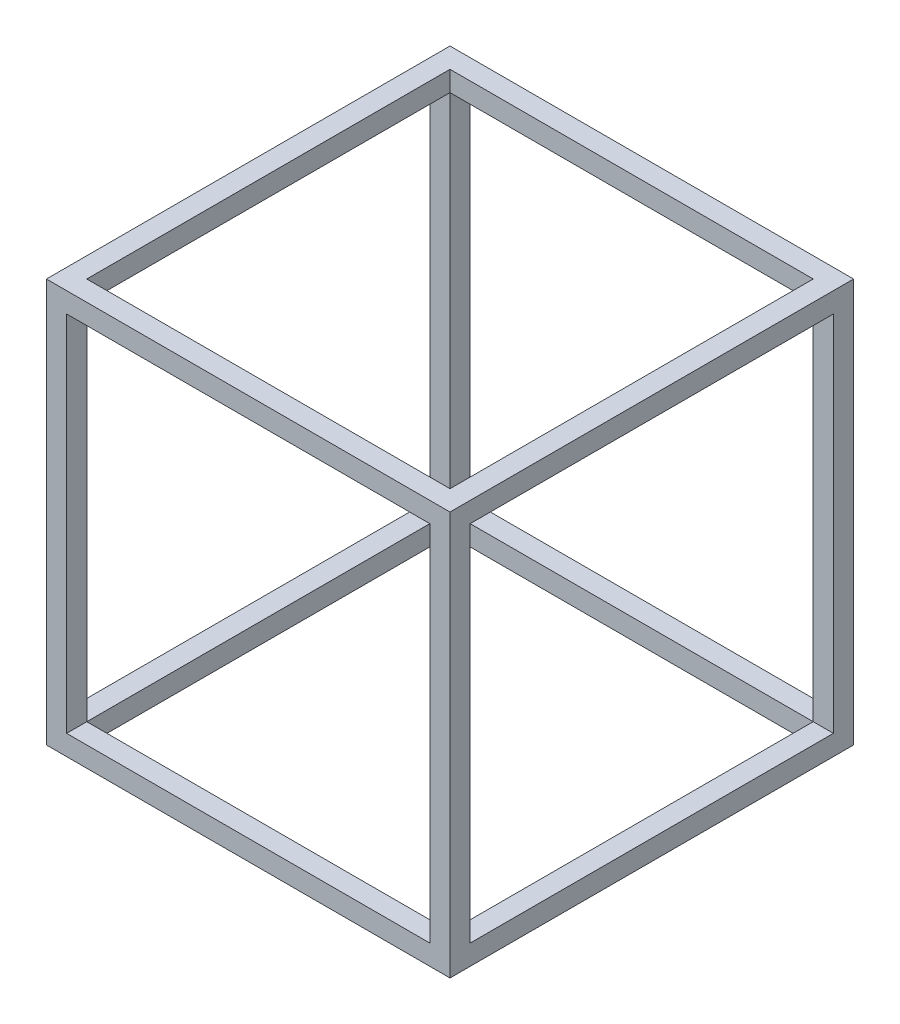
from build123d import *

# Parameters (mm, degrees)
SKETCH2_W           = 40
SKETCH2_H           = 40
SKETCH2_W_2         = 36
SKETCH2_H_2         = 36
EXTRUDE_THIN4_DEPTH = 40
SKETCH8_W           = 36
SKETCH8_H           = 36
CUT_EXTRUDE3_DEPTH  = 2
SKETCH9_W           = 36
SKETCH9_H           = 36
CUT_EXTRUDE4_DEPTH  = 2
SKETCH10_W          = 36
SKETCH10_H          = 36
CUT_EXTRUDE5_DEPTH  = 2
SKETCH12_W          = 36
SKETCH12_H          = 36
CUT_EXTRUDE6_DEPTH  = 2


with BuildPart() as part:
    # Sketch2 → Extrude-Thin4 (new body)
    with BuildSketch(Plane.XY):
        with Locations((20, 20)):
            Rectangle(SKETCH2_W, SKETCH2_H)
        with Locations((20, 20)):
            Rectangle(SKETCH2_W_2, SKETCH2_H_2, mode=Mode.SUBTRACT)
    extrude(amount=-EXTRUDE_THIN4_DEPTH)

    # Sketch8 → Cut-Extrude3 (cut)
    with BuildSketch(Plane(origin=(40, 0, 0), x_dir=(0, 0, -1), z_dir=(1, 0, 0))):
        with Locations((20, 20)):
            Rectangle(SKETCH8_W, SKETCH8_H)
    extrude(amount=-CUT_EXTRUDE3_DEPTH, mode=Mode.SUBTRACT)

    # Sketch9 → Cut-Extrude4 (cut)
    with BuildSketch(Plane.ZY):
        with Locations((-20, 20)):
            Rectangle(SKETCH9_W, SKETCH9_H)
    extrude(amount=-CUT_EXTRUDE4_DEPTH, mode=Mode.SUBTRACT)

    # Sketch10 → Cut-Extrude5 (cut)
    with BuildSketch(Plane(origin=(0, 40, 0), x_dir=(1, 0, 0), z_dir=(0, 1, 0))):
        with Locations((20, 20)):
            Rectangle(SKETCH10_W, SKETCH10_H)
    extrude(amount=-CUT_EXTRUDE5_DEPTH, mode=Mode.SUBTRACT)

    # Sketch12 → Cut-Extrude6 (cut)
    with BuildSketch(Plane.XZ):
        with Locations((20, -20)):
            Rectangle(SKETCH12_W, SKETCH12_H)
    extrude(amount=-CUT_EXTRUDE6_DEPTH, mode=Mode.SUBTRACT)


solid = part.part
